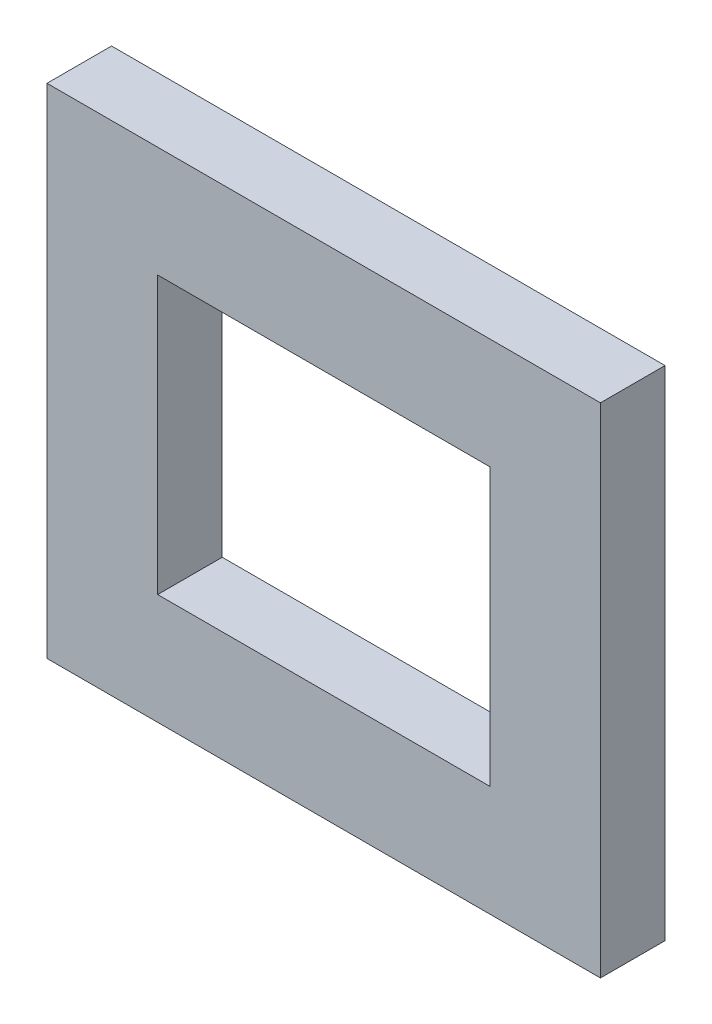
ISO-10303-21;
HEADER;
FILE_DESCRIPTION(('STEP AP214'),'2;1');
FILE_NAME('part.step','',(''),(''),'','','');
FILE_SCHEMA(('AUTOMOTIVE_DESIGN { 1 0 10303 214 1 1 1 1 }'));
ENDSEC;
DATA;
#1=APPLICATION_CONTEXT('core data for automotive mechanical design processes');
#2=APPLICATION_PROTOCOL_DEFINITION('international standard','automotive_design',2000,#1);
#3=PRODUCT_CONTEXT('',#1,'mechanical');
#4=PRODUCT('Part','Part','',(#3));
#5=PRODUCT_RELATED_PRODUCT_CATEGORY('part','',(#4));
#6=PRODUCT_DEFINITION_FORMATION('','',#4);
#7=PRODUCT_DEFINITION_CONTEXT('part definition',#1,'design');
#8=PRODUCT_DEFINITION('design','',#6,#7);
#9=PRODUCT_DEFINITION_SHAPE('','',#8);
#10=(LENGTH_UNIT() NAMED_UNIT(*) SI_UNIT(.MILLI.,.METRE.));
#11=(NAMED_UNIT(*) PLANE_ANGLE_UNIT() SI_UNIT($,.RADIAN.));
#12=(NAMED_UNIT(*) SI_UNIT($,.STERADIAN.) SOLID_ANGLE_UNIT());
#13=UNCERTAINTY_MEASURE_WITH_UNIT(LENGTH_MEASURE(1.E-05),#10,'distance_accuracy_value','');
#14=(GEOMETRIC_REPRESENTATION_CONTEXT(3) GLOBAL_UNCERTAINTY_ASSIGNED_CONTEXT((#13)) GLOBAL_UNIT_ASSIGNED_CONTEXT((#10,
#11,#12)) REPRESENTATION_CONTEXT('',''));
#15=CARTESIAN_POINT('',(0.,0.,0.));
#16=DIRECTION('',(0.,0.,1.));
#17=DIRECTION('',(1.,0.,0.));
#18=AXIS2_PLACEMENT_3D('',#15,#16,#17);
#19=CARTESIAN_POINT('',(0.,0.,22.225));
#20=DIRECTION('',(0.,0.,1.));
#21=DIRECTION('',(1.,0.,0.));
#22=AXIS2_PLACEMENT_3D('',#19,#20,#21);
#23=PLANE('',#22);
#24=DIRECTION('',(0.,-1.,0.));
#25=VECTOR('',#24,1.);
#26=CARTESIAN_POINT('',(-95.25,85.725,22.225));
#27=LINE('',#26,#25);
#28=CARTESIAN_POINT('',(-95.25,85.725,22.225));
#29=VERTEX_POINT('',#28);
#30=CARTESIAN_POINT('',(-95.25,-85.725,22.225));
#31=VERTEX_POINT('',#30);
#32=EDGE_CURVE('E136',#29,#31,#27,.T.);
#33=ORIENTED_EDGE('',*,*,#32,.T.);
#34=DIRECTION('',(1.,0.,0.));
#35=VECTOR('',#34,1.);
#36=CARTESIAN_POINT('',(-95.25,-85.725,22.225));
#37=LINE('',#36,#35);
#38=CARTESIAN_POINT('',(95.25,-85.725,22.225));
#39=VERTEX_POINT('',#38);
#40=EDGE_CURVE('E139',#31,#39,#37,.T.);
#41=ORIENTED_EDGE('',*,*,#40,.T.);
#42=DIRECTION('',(0.,1.,0.));
#43=VECTOR('',#42,1.);
#44=CARTESIAN_POINT('',(95.25,85.725,22.225));
#45=LINE('',#44,#43);
#46=CARTESIAN_POINT('',(95.25,85.725,22.225));
#47=VERTEX_POINT('',#46);
#48=EDGE_CURVE('E142',#39,#47,#45,.T.);
#49=ORIENTED_EDGE('',*,*,#48,.T.);
#50=DIRECTION('',(-1.,0.,0.));
#51=VECTOR('',#50,1.);
#52=CARTESIAN_POINT('',(-95.25,85.725,22.225));
#53=LINE('',#52,#51);
#54=EDGE_CURVE('E144',#47,#29,#53,.T.);
#55=ORIENTED_EDGE('',*,*,#54,.T.);
#56=EDGE_LOOP('',(#33,#41,#49,#55));
#57=FACE_BOUND('',#56,.T.);
#58=DIRECTION('',(0.,-1.,0.));
#59=VECTOR('',#58,1.);
#60=CARTESIAN_POINT('',(-57.15,47.625,22.225));
#61=LINE('',#60,#59);
#62=CARTESIAN_POINT('',(-57.15,47.625,22.225));
#63=VERTEX_POINT('',#62);
#64=CARTESIAN_POINT('',(-57.15,-47.625,22.225));
#65=VERTEX_POINT('',#64);
#66=EDGE_CURVE('E108',#63,#65,#61,.T.);
#67=ORIENTED_EDGE('',*,*,#66,.F.);
#68=DIRECTION('',(-1.,0.,0.));
#69=VECTOR('',#68,1.);
#70=CARTESIAN_POINT('',(-57.15,47.625,22.225));
#71=LINE('',#70,#69);
#72=CARTESIAN_POINT('',(57.15,47.625,22.225));
#73=VERTEX_POINT('',#72);
#74=EDGE_CURVE('E100',#73,#63,#71,.T.);
#75=ORIENTED_EDGE('',*,*,#74,.F.);
#76=DIRECTION('',(0.,1.,0.));
#77=VECTOR('',#76,1.);
#78=CARTESIAN_POINT('',(57.15,47.625,22.225));
#79=LINE('',#78,#77);
#80=CARTESIAN_POINT('',(57.15,-47.625,22.225));
#81=VERTEX_POINT('',#80);
#82=EDGE_CURVE('E122',#81,#73,#79,.T.);
#83=ORIENTED_EDGE('',*,*,#82,.F.);
#84=DIRECTION('',(1.,0.,0.));
#85=VECTOR('',#84,1.);
#86=CARTESIAN_POINT('',(-57.15,-47.625,22.225));
#87=LINE('',#86,#85);
#88=EDGE_CURVE('E120',#65,#81,#87,.T.);
#89=ORIENTED_EDGE('',*,*,#88,.F.);
#90=EDGE_LOOP('',(#67,#75,#83,#89));
#91=FACE_BOUND('',#90,.T.);
#92=ADVANCED_FACE('F35',(#57,#91),#23,.T.);
#93=CARTESIAN_POINT('',(0.,0.,0.));
#94=DIRECTION('',(0.,0.,1.));
#95=DIRECTION('',(1.,0.,0.));
#96=AXIS2_PLACEMENT_3D('',#93,#94,#95);
#97=PLANE('',#96);
#98=DIRECTION('',(0.,-1.,0.));
#99=VECTOR('',#98,1.);
#100=CARTESIAN_POINT('',(-95.25,85.725,0.));
#101=LINE('',#100,#99);
#102=CARTESIAN_POINT('',(-95.25,85.725,0.));
#103=VERTEX_POINT('',#102);
#104=CARTESIAN_POINT('',(-95.25,-85.725,0.));
#105=VERTEX_POINT('',#104);
#106=EDGE_CURVE('E116',#103,#105,#101,.T.);
#107=ORIENTED_EDGE('',*,*,#106,.F.);
#108=DIRECTION('',(-1.,0.,0.));
#109=VECTOR('',#108,1.);
#110=CARTESIAN_POINT('',(-95.25,85.725,0.));
#111=LINE('',#110,#109);
#112=CARTESIAN_POINT('',(95.25,85.725,0.));
#113=VERTEX_POINT('',#112);
#114=EDGE_CURVE('E140',#113,#103,#111,.T.);
#115=ORIENTED_EDGE('',*,*,#114,.F.);
#116=DIRECTION('',(0.,1.,0.));
#117=VECTOR('',#116,1.);
#118=CARTESIAN_POINT('',(95.25,85.725,0.));
#119=LINE('',#118,#117);
#120=CARTESIAN_POINT('',(95.25,-85.725,0.));
#121=VERTEX_POINT('',#120);
#122=EDGE_CURVE('E151',#121,#113,#119,.T.);
#123=ORIENTED_EDGE('',*,*,#122,.F.);
#124=DIRECTION('',(1.,0.,0.));
#125=VECTOR('',#124,1.);
#126=CARTESIAN_POINT('',(-95.25,-85.725,0.));
#127=LINE('',#126,#125);
#128=EDGE_CURVE('E149',#105,#121,#127,.T.);
#129=ORIENTED_EDGE('',*,*,#128,.F.);
#130=EDGE_LOOP('',(#107,#115,#123,#129));
#131=FACE_BOUND('',#130,.T.);
#132=DIRECTION('',(-1.,0.,0.));
#133=VECTOR('',#132,1.);
#134=CARTESIAN_POINT('',(-57.15,47.625,0.));
#135=LINE('',#134,#133);
#136=CARTESIAN_POINT('',(57.15,47.625,0.));
#137=VERTEX_POINT('',#136);
#138=CARTESIAN_POINT('',(-57.15,47.625,0.));
#139=VERTEX_POINT('',#138);
#140=EDGE_CURVE('E58',#137,#139,#135,.T.);
#141=ORIENTED_EDGE('',*,*,#140,.T.);
#142=DIRECTION('',(0.,-1.,0.));
#143=VECTOR('',#142,1.);
#144=CARTESIAN_POINT('',(-57.15,47.625,0.));
#145=LINE('',#144,#143);
#146=CARTESIAN_POINT('',(-57.15,-47.625,0.));
#147=VERTEX_POINT('',#146);
#148=EDGE_CURVE('E115',#139,#147,#145,.T.);
#149=ORIENTED_EDGE('',*,*,#148,.T.);
#150=DIRECTION('',(1.,0.,0.));
#151=VECTOR('',#150,1.);
#152=CARTESIAN_POINT('',(-57.15,-47.625,0.));
#153=LINE('',#152,#151);
#154=CARTESIAN_POINT('',(57.15,-47.625,0.));
#155=VERTEX_POINT('',#154);
#156=EDGE_CURVE('E128',#147,#155,#153,.T.);
#157=ORIENTED_EDGE('',*,*,#156,.T.);
#158=DIRECTION('',(0.,1.,0.));
#159=VECTOR('',#158,1.);
#160=CARTESIAN_POINT('',(57.15,47.625,0.));
#161=LINE('',#160,#159);
#162=EDGE_CURVE('E109',#155,#137,#161,.T.);
#163=ORIENTED_EDGE('',*,*,#162,.T.);
#164=EDGE_LOOP('',(#141,#149,#157,#163));
#165=FACE_BOUND('',#164,.T.);
#166=ADVANCED_FACE('F169',(#131,#165),#97,.F.);
#167=CARTESIAN_POINT('',(-95.25,85.725,22.225));
#168=DIRECTION('',(1.,0.,0.));
#169=DIRECTION('',(0.,0.,-1.));
#170=AXIS2_PLACEMENT_3D('',#167,#168,#169);
#171=PLANE('',#170);
#172=ORIENTED_EDGE('',*,*,#106,.T.);
#173=DIRECTION('',(0.,0.,-1.));
#174=VECTOR('',#173,1.);
#175=CARTESIAN_POINT('',(-95.25,-85.725,22.225));
#176=LINE('',#175,#174);
#177=EDGE_CURVE('E11',#31,#105,#176,.T.);
#178=ORIENTED_EDGE('',*,*,#177,.F.);
#179=ORIENTED_EDGE('',*,*,#32,.F.);
#180=DIRECTION('',(0.,0.,-1.));
#181=VECTOR('',#180,1.);
#182=CARTESIAN_POINT('',(-95.25,85.725,22.225));
#183=LINE('',#182,#181);
#184=EDGE_CURVE('E146',#29,#103,#183,.T.);
#185=ORIENTED_EDGE('',*,*,#184,.T.);
#186=EDGE_LOOP('',(#172,#178,#179,#185));
#187=FACE_BOUND('',#186,.T.);
#188=ADVANCED_FACE('F37',(#187),#171,.F.);
#189=CARTESIAN_POINT('',(-95.25,-85.725,22.225));
#190=DIRECTION('',(0.,1.,0.));
#191=DIRECTION('',(0.,0.,1.));
#192=AXIS2_PLACEMENT_3D('',#189,#190,#191);
#193=PLANE('',#192);
#194=ORIENTED_EDGE('',*,*,#128,.T.);
#195=DIRECTION('',(0.,0.,-1.));
#196=VECTOR('',#195,1.);
#197=CARTESIAN_POINT('',(95.25,-85.725,22.225));
#198=LINE('',#197,#196);
#199=EDGE_CURVE('E43',#39,#121,#198,.T.);
#200=ORIENTED_EDGE('',*,*,#199,.F.);
#201=ORIENTED_EDGE('',*,*,#40,.F.);
#202=ORIENTED_EDGE('',*,*,#177,.T.);
#203=EDGE_LOOP('',(#194,#200,#201,#202));
#204=FACE_BOUND('',#203,.T.);
#205=ADVANCED_FACE('F179',(#204),#193,.F.);
#206=CARTESIAN_POINT('',(95.25,85.725,22.225));
#207=DIRECTION('',(-1.,0.,0.));
#208=DIRECTION('',(0.,0.,1.));
#209=AXIS2_PLACEMENT_3D('',#206,#207,#208);
#210=PLANE('',#209);
#211=ORIENTED_EDGE('',*,*,#122,.T.);
#212=DIRECTION('',(0.,0.,-1.));
#213=VECTOR('',#212,1.);
#214=CARTESIAN_POINT('',(95.25,85.725,22.225));
#215=LINE('',#214,#213);
#216=EDGE_CURVE('E156',#47,#113,#215,.T.);
#217=ORIENTED_EDGE('',*,*,#216,.F.);
#218=ORIENTED_EDGE('',*,*,#48,.F.);
#219=ORIENTED_EDGE('',*,*,#199,.T.);
#220=EDGE_LOOP('',(#211,#217,#218,#219));
#221=FACE_BOUND('',#220,.T.);
#222=ADVANCED_FACE('F163',(#221),#210,.F.);
#223=CARTESIAN_POINT('',(-95.25,85.725,22.225));
#224=DIRECTION('',(0.,-1.,0.));
#225=DIRECTION('',(0.,0.,-1.));
#226=AXIS2_PLACEMENT_3D('',#223,#224,#225);
#227=PLANE('',#226);
#228=ORIENTED_EDGE('',*,*,#114,.T.);
#229=ORIENTED_EDGE('',*,*,#184,.F.);
#230=ORIENTED_EDGE('',*,*,#54,.F.);
#231=ORIENTED_EDGE('',*,*,#216,.T.);
#232=EDGE_LOOP('',(#228,#229,#230,#231));
#233=FACE_BOUND('',#232,.T.);
#234=ADVANCED_FACE('F173',(#233),#227,.F.);
#235=CARTESIAN_POINT('',(-57.15,47.625,22.225));
#236=DIRECTION('',(0.,-1.,0.));
#237=DIRECTION('',(1.,0.,0.));
#238=AXIS2_PLACEMENT_3D('',#235,#236,#237);
#239=PLANE('',#238);
#240=ORIENTED_EDGE('',*,*,#140,.F.);
#241=DIRECTION('',(0.,0.,-1.));
#242=VECTOR('',#241,1.);
#243=CARTESIAN_POINT('',(57.15,47.625,22.225));
#244=LINE('',#243,#242);
#245=EDGE_CURVE('E104',#73,#137,#244,.T.);
#246=ORIENTED_EDGE('',*,*,#245,.F.);
#247=ORIENTED_EDGE('',*,*,#74,.T.);
#248=DIRECTION('',(0.,0.,-1.));
#249=VECTOR('',#248,1.);
#250=CARTESIAN_POINT('',(-57.15,47.625,22.225));
#251=LINE('',#250,#249);
#252=EDGE_CURVE('E103',#63,#139,#251,.T.);
#253=ORIENTED_EDGE('',*,*,#252,.T.);
#254=EDGE_LOOP('',(#240,#246,#247,#253));
#255=FACE_BOUND('',#254,.T.);
#256=ADVANCED_FACE('F102',(#255),#239,.T.);
#257=CARTESIAN_POINT('',(-57.15,47.625,22.225));
#258=DIRECTION('',(1.,0.,0.));
#259=DIRECTION('',(0.,1.,0.));
#260=AXIS2_PLACEMENT_3D('',#257,#258,#259);
#261=PLANE('',#260);
#262=ORIENTED_EDGE('',*,*,#148,.F.);
#263=ORIENTED_EDGE('',*,*,#252,.F.);
#264=ORIENTED_EDGE('',*,*,#66,.T.);
#265=DIRECTION('',(0.,0.,-1.));
#266=VECTOR('',#265,1.);
#267=CARTESIAN_POINT('',(-57.15,-47.625,22.225));
#268=LINE('',#267,#266);
#269=EDGE_CURVE('E117',#65,#147,#268,.T.);
#270=ORIENTED_EDGE('',*,*,#269,.T.);
#271=EDGE_LOOP('',(#262,#263,#264,#270));
#272=FACE_BOUND('',#271,.T.);
#273=ADVANCED_FACE('F112',(#272),#261,.T.);
#274=CARTESIAN_POINT('',(-57.15,-47.625,22.225));
#275=DIRECTION('',(0.,1.,0.));
#276=DIRECTION('',(0.,0.,1.));
#277=AXIS2_PLACEMENT_3D('',#274,#275,#276);
#278=PLANE('',#277);
#279=ORIENTED_EDGE('',*,*,#156,.F.);
#280=ORIENTED_EDGE('',*,*,#269,.F.);
#281=ORIENTED_EDGE('',*,*,#88,.T.);
#282=DIRECTION('',(0.,0.,-1.));
#283=VECTOR('',#282,1.);
#284=CARTESIAN_POINT('',(57.15,-47.625,22.225));
#285=LINE('',#284,#283);
#286=EDGE_CURVE('E50',#81,#155,#285,.T.);
#287=ORIENTED_EDGE('',*,*,#286,.T.);
#288=EDGE_LOOP('',(#279,#280,#281,#287));
#289=FACE_BOUND('',#288,.T.);
#290=ADVANCED_FACE('F202',(#289),#278,.T.);
#291=CARTESIAN_POINT('',(57.15,47.625,22.225));
#292=DIRECTION('',(-1.,0.,0.));
#293=DIRECTION('',(0.,0.,1.));
#294=AXIS2_PLACEMENT_3D('',#291,#292,#293);
#295=PLANE('',#294);
#296=ORIENTED_EDGE('',*,*,#162,.F.);
#297=ORIENTED_EDGE('',*,*,#286,.F.);
#298=ORIENTED_EDGE('',*,*,#82,.T.);
#299=ORIENTED_EDGE('',*,*,#245,.T.);
#300=EDGE_LOOP('',(#296,#297,#298,#299));
#301=FACE_BOUND('',#300,.T.);
#302=ADVANCED_FACE('F206',(#301),#295,.T.);
#303=CLOSED_SHELL('',(#92,#166,#188,#205,#222,#234,#256,#273,#290,#302));
#304=MANIFOLD_SOLID_BREP('B2',#303);
#305=ADVANCED_BREP_SHAPE_REPRESENTATION('',(#18,#304),#14);
#306=SHAPE_DEFINITION_REPRESENTATION(#9,#305);
ENDSEC;
END-ISO-10303-21;
